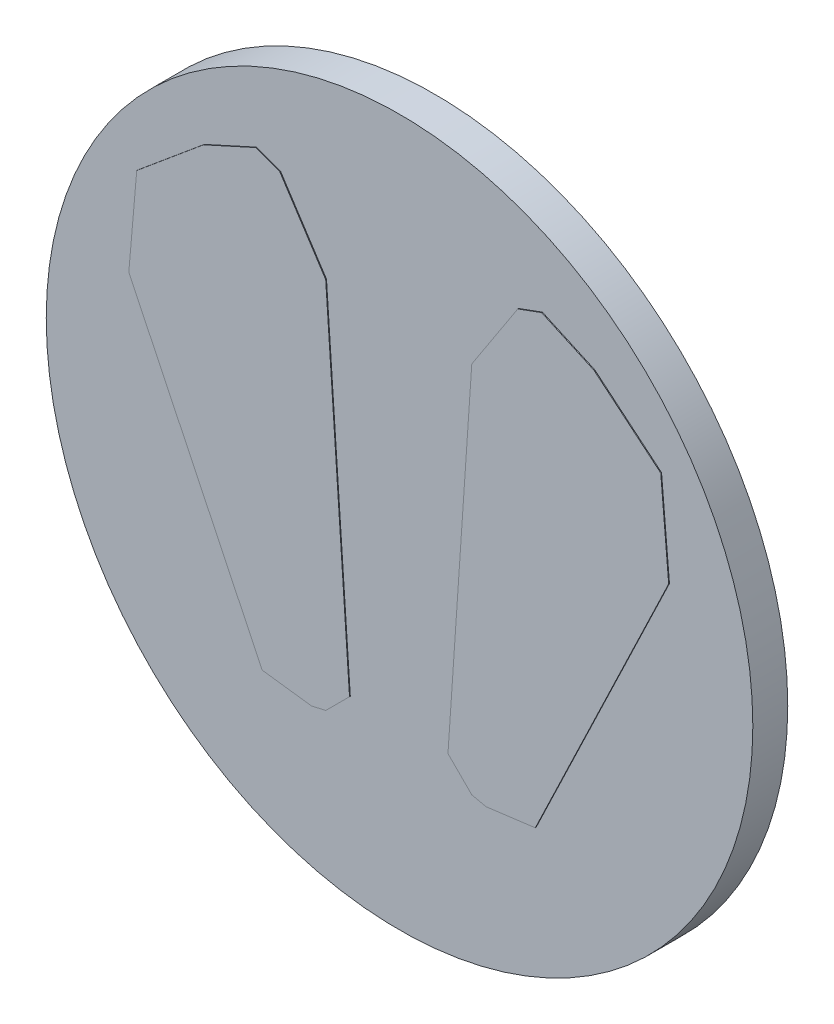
from build123d import *

# Parameters (mm, degrees)
ESQUISSE1_R      = 222.5
EXTRUSION1_DEPTH = 22
EXTRUSION4_DEPTH = 0.5


with BuildPart() as part:
    # Esquisse1 → Extrusion1 (new body)
    with BuildSketch(Plane.XY):
        Circle(ESQUISSE1_R)
    extrude(amount=EXTRUSION1_DEPTH)

    # Esquisse2 → Extrusion4 (add)
    with BuildSketch(Plane.XY.offset(22)):
        Polygon((31, -110.5), (46, 109.5), (75, 154), (90, 159.5), (123, 144.5), (165, 109.5), (170, 51.5), (86, -123.5), (55, -127.5), (46, -125.5), align=None)
        Polygon((-55, -127.5), (-46, -125.5), (-31, -110.5), (-46, 109.5), (-75, 154), (-90, 159.5), (-123, 144.5), (-165, 109.5), (-170, 51.5), (-86, -123.5), align=None)
    extrude(amount=EXTRUSION4_DEPTH)


solid = part.part
